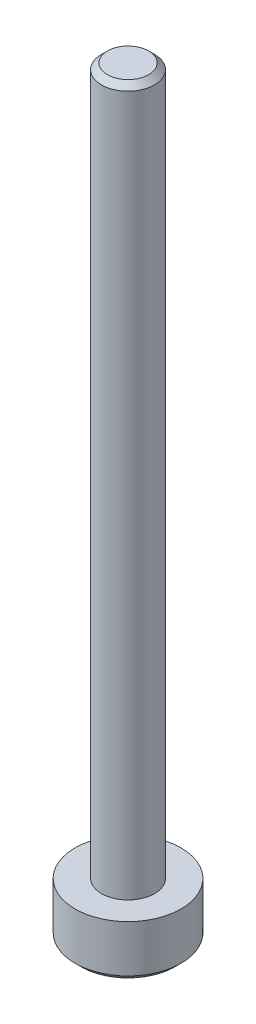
from build123d import *

# Parameters (mm, degrees)
SKETCH1_R           = 1.5
BOSS_EXTRUDE1_DEPTH = 40
SKETCH2_R           = 3
BOSS_EXTRUDE2_DEPTH = 3
CUT_EXTRUDE1_DEPTH  = 2
CHAMFER1_SIZE       = 0.333333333


with BuildPart() as part:
    # Sketch1 → Boss-Extrude1 (new body)
    with BuildSketch(Plane(origin=(0, 0, 0), x_dir=(1, 0, 0), z_dir=(0, 1, 0))):
        with Locations(Location((0, 0, 0), (0, 0, 270))):
            Circle(SKETCH1_R)
    extrude(amount=BOSS_EXTRUDE1_DEPTH)

    # Sketch2 → Boss-Extrude2 (add)
    with BuildSketch(Plane.XZ):
        with Locations(Location((0, 0, 0), (0, 0, 270))):
            Circle(SKETCH2_R)
    extrude(amount=BOSS_EXTRUDE2_DEPTH)

    # Sketch3 → Cut-Extrude1 (cut)
    with BuildSketch(Plane.XZ.offset(3)):
        Polygon((0, 1.732050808), (-1.5, 0.866025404), (-1.5, -0.866025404), (0, -1.732050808), (1.5, -0.866025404), (1.5, 0.866025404), align=None)
    extrude(amount=-CUT_EXTRUDE1_DEPTH, mode=Mode.SUBTRACT)

    # Chamfer1
    chamfer1_edges = [part.edges().sort_by_distance(p)[0] for p in [
        (0, 40, -1.5),
        (0, -3, 3),
    ]]
    chamfer(chamfer1_edges, length=CHAMFER1_SIZE)


solid = part.part
